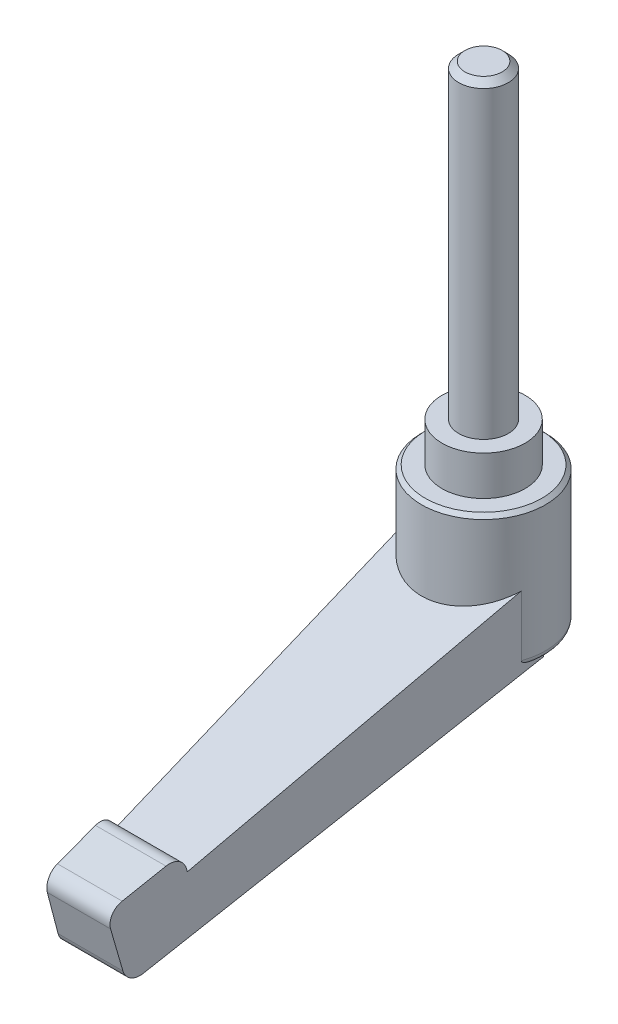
ISO-10303-21;
HEADER;
FILE_DESCRIPTION(('STEP AP214'),'2;1');
FILE_NAME('part.step','',(''),(''),'','','');
FILE_SCHEMA(('AUTOMOTIVE_DESIGN { 1 0 10303 214 1 1 1 1 }'));
ENDSEC;
DATA;
#1=APPLICATION_CONTEXT('core data for automotive mechanical design processes');
#2=APPLICATION_PROTOCOL_DEFINITION('international standard','automotive_design',2000,#1);
#3=PRODUCT_CONTEXT('',#1,'mechanical');
#4=PRODUCT('Part','Part','',(#3));
#5=PRODUCT_RELATED_PRODUCT_CATEGORY('part','',(#4));
#6=PRODUCT_DEFINITION_FORMATION('','',#4);
#7=PRODUCT_DEFINITION_CONTEXT('part definition',#1,'design');
#8=PRODUCT_DEFINITION('design','',#6,#7);
#9=PRODUCT_DEFINITION_SHAPE('','',#8);
#10=(LENGTH_UNIT() NAMED_UNIT(*) SI_UNIT(.MILLI.,.METRE.));
#11=(NAMED_UNIT(*) PLANE_ANGLE_UNIT() SI_UNIT($,.RADIAN.));
#12=(NAMED_UNIT(*) SI_UNIT($,.STERADIAN.) SOLID_ANGLE_UNIT());
#13=UNCERTAINTY_MEASURE_WITH_UNIT(LENGTH_MEASURE(1.E-05),#10,'distance_accuracy_value','');
#14=(GEOMETRIC_REPRESENTATION_CONTEXT(3) GLOBAL_UNCERTAINTY_ASSIGNED_CONTEXT((#13)) GLOBAL_UNIT_ASSIGNED_CONTEXT((#10,
#11,#12)) REPRESENTATION_CONTEXT('',''));
#15=CARTESIAN_POINT('',(0.,0.,0.));
#16=DIRECTION('',(0.,0.,1.));
#17=DIRECTION('',(1.,0.,0.));
#18=AXIS2_PLACEMENT_3D('',#15,#16,#17);
#19=CARTESIAN_POINT('',(22.5,-70.,30.));
#20=DIRECTION('',(0.,-1.,0.));
#21=DIRECTION('',(0.,0.,-1.));
#22=AXIS2_PLACEMENT_3D('',#19,#20,#21);
#23=PLANE('',#22);
#24=CARTESIAN_POINT('',(22.5,-70.,30.));
#25=DIRECTION('',(0.,-1.,0.));
#26=DIRECTION('',(0.,0.,-1.));
#27=AXIS2_PLACEMENT_3D('',#24,#25,#26);
#28=CIRCLE('',#27,6.06923098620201);
#29=CARTESIAN_POINT('',(22.5,-70.,23.930769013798));
#30=VERTEX_POINT('',#29);
#31=EDGE_CURVE('E19',#30,#30,#28,.F.);
#32=ORIENTED_EDGE('',*,*,#31,.F.);
#33=EDGE_LOOP('',(#32));
#34=FACE_BOUND('',#33,.T.);
#35=ADVANCED_FACE('F16',(#34),#23,.T.);
#36=CARTESIAN_POINT('',(22.5,-68.5,30.));
#37=DIRECTION('',(0.,-1.,0.));
#38=DIRECTION('',(0.,0.,-1.));
#39=AXIS2_PLACEMENT_3D('',#36,#37,#38);
#40=CYLINDRICAL_SURFACE('',#39,6.06923098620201);
#41=ORIENTED_EDGE('',*,*,#31,.T.);
#42=EDGE_LOOP('',(#41));
#43=FACE_BOUND('',#42,.T.);
#44=CARTESIAN_POINT('',(22.5,-66.9999999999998,30.));
#45=DIRECTION('',(0.,-0.965925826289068,-0.258819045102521));
#46=DIRECTION('',(0.,-0.258819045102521,0.965925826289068));
#47=AXIS2_PLACEMENT_3D('',#44,#45,#46);
#48=ELLIPSE('',#47,6.28333027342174,6.06923098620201);
#49=CARTESIAN_POINT('',(16.430769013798,-67.,30.0000000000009));
#50=VERTEX_POINT('',#49);
#51=CARTESIAN_POINT('',(28.569230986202,-67.,30.0000000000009));
#52=VERTEX_POINT('',#51);
#53=EDGE_CURVE('E94',#50,#52,#48,.F.);
#54=ORIENTED_EDGE('',*,*,#53,.F.);
#55=CARTESIAN_POINT('',(22.5,-67.,30.));
#56=DIRECTION('',(0.,-1.,0.));
#57=DIRECTION('',(0.,0.,-1.));
#58=AXIS2_PLACEMENT_3D('',#55,#56,#57);
#59=CIRCLE('',#58,6.06923098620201);
#60=EDGE_CURVE('E109',#52,#50,#59,.F.);
#61=ORIENTED_EDGE('',*,*,#60,.F.);
#62=EDGE_LOOP('',(#54,#61));
#63=FACE_BOUND('',#62,.T.);
#64=ADVANCED_FACE('F110',(#43,#63),#40,.T.);
#65=CARTESIAN_POINT('',(32.23,-72.0642139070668,83.6683718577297));
#66=DIRECTION('',(0.,0.264237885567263,-0.964457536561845));
#67=DIRECTION('',(0.,0.964457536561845,0.264237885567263));
#68=AXIS2_PLACEMENT_3D('',#65,#66,#67);
#69=PLANE('',#68);
#70=DIRECTION('',(0.0184741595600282,-0.964292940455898,-0.264192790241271));
#71=VECTOR('',#70,1.);
#72=CARTESIAN_POINT('',(28.3975822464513,-71.5214338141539,83.8170803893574));
#73=LINE('',#72,#71);
#74=CARTESIAN_POINT('',(28.3975822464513,-71.5214338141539,83.8170803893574));
#75=VERTEX_POINT('',#74);
#76=CARTESIAN_POINT('',(28.4079809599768,-72.0642139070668,83.6683718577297));
#77=VERTEX_POINT('',#76);
#78=EDGE_CURVE('E380',#75,#77,#73,.T.);
#79=ORIENTED_EDGE('',*,*,#78,.T.);
#80=DIRECTION('',(1.,0.,0.));
#81=VECTOR('',#80,1.);
#82=CARTESIAN_POINT('',(32.23,-72.0642139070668,83.6683718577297));
#83=LINE('',#82,#81);
#84=CARTESIAN_POINT('',(16.592019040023,-72.0642139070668,83.6683718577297));
#85=VERTEX_POINT('',#84);
#86=EDGE_CURVE('E187',#85,#77,#83,.T.);
#87=ORIENTED_EDGE('',*,*,#86,.F.);
#88=DIRECTION('',(0.0184741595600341,0.964292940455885,0.264192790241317));
#89=VECTOR('',#88,1.);
#90=CARTESIAN_POINT('',(16.592019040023,-72.0642139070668,83.6683718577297));
#91=LINE('',#90,#89);
#92=CARTESIAN_POINT('',(16.6024177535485,-71.5214338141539,83.8170803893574));
#93=VERTEX_POINT('',#92);
#94=EDGE_CURVE('E112',#85,#93,#91,.T.);
#95=ORIENTED_EDGE('',*,*,#94,.T.);
#96=DIRECTION('',(-1.,0.,0.));
#97=VECTOR('',#96,1.);
#98=CARTESIAN_POINT('',(32.23,-71.5214338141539,83.8170803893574));
#99=LINE('',#98,#97);
#100=EDGE_CURVE('E378',#75,#93,#99,.T.);
#101=ORIENTED_EDGE('',*,*,#100,.F.);
#102=EDGE_LOOP('',(#79,#87,#95,#101));
#103=FACE_BOUND('',#102,.T.);
#104=ADVANCED_FACE('F257',(#103),#69,.T.);
#105=CARTESIAN_POINT('',(32.23,-72.1820285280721,86.228224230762));
#106=DIRECTION('',(-1.,0.,0.));
#107=DIRECTION('',(0.,0.,1.));
#108=AXIS2_PLACEMENT_3D('',#105,#106,#107);
#109=CYLINDRICAL_SURFACE('',#108,2.5);
#110=CARTESIAN_POINT('',(28.2289786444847,-72.1820285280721,86.228224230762));
#111=DIRECTION('',(0.997564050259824,0.,0.069756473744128));
#112=DIRECTION('',(-0.069756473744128,0.,0.997564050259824));
#113=AXIS2_PLACEMENT_3D('',#110,#111,#112);
#114=ELLIPSE('',#113,2.50610474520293,2.5);
#115=CARTESIAN_POINT('',(28.1824688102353,-69.772129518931,86.8933458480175));
#116=VERTEX_POINT('',#115);
#117=EDGE_CURVE('E183',#75,#116,#114,.T.);
#118=ORIENTED_EDGE('',*,*,#117,.F.);
#119=ORIENTED_EDGE('',*,*,#100,.T.);
#120=CARTESIAN_POINT('',(16.7710213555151,-72.1820285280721,86.228224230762));
#121=DIRECTION('',(0.997564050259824,0.,-0.069756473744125));
#122=DIRECTION('',(-0.069756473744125,0.,-0.997564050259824));
#123=AXIS2_PLACEMENT_3D('',#120,#121,#122);
#124=ELLIPSE('',#123,2.50610474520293,2.5);
#125=CARTESIAN_POINT('',(16.8175311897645,-69.772129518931,86.8933458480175));
#126=VERTEX_POINT('',#125);
#127=EDGE_CURVE('E202',#93,#126,#124,.T.);
#128=ORIENTED_EDGE('',*,*,#127,.T.);
#129=DIRECTION('',(1.,0.,0.));
#130=VECTOR('',#129,1.);
#131=CARTESIAN_POINT('',(32.23,-69.772129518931,86.8933458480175));
#132=LINE('',#131,#130);
#133=EDGE_CURVE('E376',#116,#126,#132,.F.);
#134=ORIENTED_EDGE('',*,*,#133,.F.);
#135=EDGE_LOOP('',(#118,#119,#128,#134));
#136=FACE_BOUND('',#135,.T.);
#137=ADVANCED_FACE('F253',(#136),#109,.T.);
#138=CARTESIAN_POINT('',(32.23,-69.772129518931,86.8933458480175));
#139=DIRECTION('',(0.,0.96395960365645,0.266048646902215));
#140=DIRECTION('',(0.,-0.266048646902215,0.96395960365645));
#141=AXIS2_PLACEMENT_3D('',#138,#139,#140);
#142=PLANE('',#141);
#143=DIRECTION('',(-0.0672540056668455,-0.265446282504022,0.961777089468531));
#144=VECTOR('',#143,1.);
#145=CARTESIAN_POINT('',(28.1824688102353,-69.772129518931,86.8933458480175));
#146=LINE('',#145,#144);
#147=CARTESIAN_POINT('',(27.7207106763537,-71.5946526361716,93.49679481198));
#148=VERTEX_POINT('',#147);
#149=EDGE_CURVE('E180',#116,#148,#146,.T.);
#150=ORIENTED_EDGE('',*,*,#149,.F.);
#151=ORIENTED_EDGE('',*,*,#133,.T.);
#152=DIRECTION('',(0.0672540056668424,-0.265446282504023,0.961777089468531));
#153=VECTOR('',#152,1.);
#154=CARTESIAN_POINT('',(16.8175311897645,-69.772129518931,86.8933458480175));
#155=LINE('',#154,#153);
#156=CARTESIAN_POINT('',(17.2792893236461,-71.5946526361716,93.49679481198));
#157=VERTEX_POINT('',#156);
#158=EDGE_CURVE('E200',#126,#157,#155,.T.);
#159=ORIENTED_EDGE('',*,*,#158,.T.);
#160=DIRECTION('',(-1.,0.,0.));
#161=VECTOR('',#160,1.);
#162=CARTESIAN_POINT('',(32.23,-71.5946526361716,93.4967948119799));
#163=LINE('',#162,#161);
#164=EDGE_CURVE('E373',#148,#157,#163,.T.);
#165=ORIENTED_EDGE('',*,*,#164,.F.);
#166=EDGE_LOOP('',(#150,#151,#159,#165));
#167=FACE_BOUND('',#166,.T.);
#168=ADVANCED_FACE('F249',(#167),#142,.T.);
#169=CARTESIAN_POINT('',(32.23,-74.0045516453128,92.8316731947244));
#170=DIRECTION('',(-1.,0.,0.));
#171=DIRECTION('',(0.,0.,1.));
#172=AXIS2_PLACEMENT_3D('',#169,#170,#171);
#173=CYLINDRICAL_SURFACE('',#172,2.50000000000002);
#174=CARTESIAN_POINT('',(27.7672205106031,-74.0045516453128,92.8316731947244));
#175=DIRECTION('',(0.997564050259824,0.,0.069756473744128));
#176=DIRECTION('',(-0.069756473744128,0.,0.997564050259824));
#177=AXIS2_PLACEMENT_3D('',#174,#175,#176);
#178=ELLIPSE('',#177,2.50610474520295,2.50000000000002);
#179=CARTESIAN_POINT('',(27.598703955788,-74.6696732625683,95.2415722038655));
#180=VERTEX_POINT('',#179);
#181=EDGE_CURVE('E179',#148,#180,#178,.T.);
#182=ORIENTED_EDGE('',*,*,#181,.F.);
#183=ORIENTED_EDGE('',*,*,#164,.T.);
#184=CARTESIAN_POINT('',(17.2327794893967,-74.0045516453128,92.8316731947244));
#185=DIRECTION('',(0.997564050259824,0.,-0.069756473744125));
#186=DIRECTION('',(-0.069756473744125,0.,-0.997564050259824));
#187=AXIS2_PLACEMENT_3D('',#184,#185,#186);
#188=ELLIPSE('',#187,2.50610474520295,2.50000000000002);
#189=CARTESIAN_POINT('',(17.4012960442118,-74.6696732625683,95.2415722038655));
#190=VERTEX_POINT('',#189);
#191=EDGE_CURVE('E199',#157,#190,#188,.T.);
#192=ORIENTED_EDGE('',*,*,#191,.T.);
#193=DIRECTION('',(1.,0.,0.));
#194=VECTOR('',#193,1.);
#195=CARTESIAN_POINT('',(32.23,-74.6696732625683,95.2415722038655));
#196=LINE('',#195,#194);
#197=EDGE_CURVE('E370',#180,#190,#196,.F.);
#198=ORIENTED_EDGE('',*,*,#197,.F.);
#199=EDGE_LOOP('',(#182,#183,#192,#198));
#200=FACE_BOUND('',#199,.T.);
#201=ADVANCED_FACE('F245',(#200),#173,.T.);
#202=CARTESIAN_POINT('',(32.23,-74.6696732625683,95.2415722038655));
#203=DIRECTION('',(0.,-0.266048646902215,0.96395960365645));
#204=DIRECTION('',(0.,-0.96395960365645,-0.266048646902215));
#205=AXIS2_PLACEMENT_3D('',#202,#203,#204);
#206=PLANE('',#205);
#207=DIRECTION('',(0.0186007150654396,-0.963792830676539,-0.266002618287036));
#208=VECTOR('',#207,1.);
#209=CARTESIAN_POINT('',(27.598703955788,-74.6696732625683,95.2415722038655));
#210=LINE('',#209,#208);
#211=CARTESIAN_POINT('',(27.7288636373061,-81.4138746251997,93.3802020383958));
#212=VERTEX_POINT('',#211);
#213=EDGE_CURVE('E176',#180,#212,#210,.T.);
#214=ORIENTED_EDGE('',*,*,#213,.F.);
#215=ORIENTED_EDGE('',*,*,#197,.T.);
#216=DIRECTION('',(-0.0186007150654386,-0.963792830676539,-0.266002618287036));
#217=VECTOR('',#216,1.);
#218=CARTESIAN_POINT('',(17.4012960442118,-74.6696732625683,95.2415722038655));
#219=LINE('',#218,#217);
#220=CARTESIAN_POINT('',(17.2711363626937,-81.4138746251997,93.3802020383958));
#221=VERTEX_POINT('',#220);
#222=EDGE_CURVE('E197',#190,#221,#219,.T.);
#223=ORIENTED_EDGE('',*,*,#222,.T.);
#224=DIRECTION('',(-1.,0.,0.));
#225=VECTOR('',#224,1.);
#226=CARTESIAN_POINT('',(32.23,-81.4138746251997,93.3802020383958));
#227=LINE('',#226,#225);
#228=EDGE_CURVE('E108',#212,#221,#227,.T.);
#229=ORIENTED_EDGE('',*,*,#228,.F.);
#230=EDGE_LOOP('',(#214,#215,#223,#229));
#231=FACE_BOUND('',#230,.T.);
#232=ADVANCED_FACE('F241',(#231),#206,.T.);
#233=CARTESIAN_POINT('',(32.23,-80.7487530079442,90.9703030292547));
#234=DIRECTION('',(-1.,0.,0.));
#235=DIRECTION('',(0.,0.,1.));
#236=AXIS2_PLACEMENT_3D('',#233,#234,#235);
#237=CYLINDRICAL_SURFACE('',#236,2.50000000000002);
#238=CARTESIAN_POINT('',(27.8973801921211,-80.7487530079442,90.9703030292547));
#239=DIRECTION('',(0.997564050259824,0.,0.069756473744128));
#240=DIRECTION('',(-0.069756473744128,0.,0.997564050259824));
#241=AXIS2_PLACEMENT_3D('',#238,#239,#240);
#242=ELLIPSE('',#241,2.50610474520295,2.50000000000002);
#243=CARTESIAN_POINT('',(27.9426261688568,-83.1635675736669,90.3232554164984));
#244=VERTEX_POINT('',#243);
#245=EDGE_CURVE('E175',#212,#244,#242,.T.);
#246=ORIENTED_EDGE('',*,*,#245,.F.);
#247=ORIENTED_EDGE('',*,*,#228,.T.);
#248=CARTESIAN_POINT('',(17.1026198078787,-80.7487530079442,90.9703030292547));
#249=DIRECTION('',(0.997564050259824,0.,-0.069756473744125));
#250=DIRECTION('',(-0.069756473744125,0.,-0.997564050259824));
#251=AXIS2_PLACEMENT_3D('',#248,#249,#250);
#252=ELLIPSE('',#251,2.50610474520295,2.50000000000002);
#253=CARTESIAN_POINT('',(17.0573738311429,-83.1635675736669,90.3232554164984));
#254=VERTEX_POINT('',#253);
#255=EDGE_CURVE('E196',#221,#254,#252,.T.);
#256=ORIENTED_EDGE('',*,*,#255,.T.);
#257=DIRECTION('',(1.,0.,0.));
#258=VECTOR('',#257,1.);
#259=CARTESIAN_POINT('',(32.23,-83.1635675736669,90.3232554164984));
#260=LINE('',#259,#258);
#261=EDGE_CURVE('E107',#244,#254,#260,.F.);
#262=ORIENTED_EDGE('',*,*,#261,.F.);
#263=EDGE_LOOP('',(#246,#247,#256,#262));
#264=FACE_BOUND('',#263,.T.);
#265=ADVANCED_FACE('F238',(#264),#237,.T.);
#266=CARTESIAN_POINT('',(32.23,-83.1635675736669,90.3232554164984));
#267=DIRECTION('',(0.,-0.965925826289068,-0.258819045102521));
#268=DIRECTION('',(0.,0.258819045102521,-0.965925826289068));
#269=AXIS2_PLACEMENT_3D('',#266,#267,#268);
#270=PLANE('',#269);
#271=DIRECTION('',(-1.,0.,0.));
#272=VECTOR('',#271,1.);
#273=CARTESIAN_POINT('',(32.23,-67.,30.));
#274=LINE('',#273,#272);
#275=CARTESIAN_POINT('',(13.5,-67.,30.0000000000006));
#276=VERTEX_POINT('',#275);
#277=CARTESIAN_POINT('',(12.8391608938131,-66.9999999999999,30.));
#278=VERTEX_POINT('',#277);
#279=EDGE_CURVE('E358',#276,#278,#274,.T.);
#280=ORIENTED_EDGE('',*,*,#279,.F.);
#281=DIRECTION('',(1.,0.,0.));
#282=VECTOR('',#281,1.);
#283=CARTESIAN_POINT('',(22.5,-67.,30.0000000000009));
#284=LINE('',#283,#282);
#285=EDGE_CURVE('E105',#50,#276,#284,.F.);
#286=ORIENTED_EDGE('',*,*,#285,.F.);
#287=ORIENTED_EDGE('',*,*,#53,.T.);
#288=DIRECTION('',(1.,0.,0.));
#289=VECTOR('',#288,1.);
#290=CARTESIAN_POINT('',(22.5,-67.,30.0000000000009));
#291=LINE('',#290,#289);
#292=CARTESIAN_POINT('',(31.5,-67.,30.0000000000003));
#293=VERTEX_POINT('',#292);
#294=EDGE_CURVE('E102',#293,#52,#291,.F.);
#295=ORIENTED_EDGE('',*,*,#294,.F.);
#296=DIRECTION('',(-1.,0.,0.));
#297=VECTOR('',#296,1.);
#298=CARTESIAN_POINT('',(32.23,-66.9999999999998,30.));
#299=LINE('',#298,#297);
#300=CARTESIAN_POINT('',(32.1608391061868,-66.9999999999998,30.));
#301=VERTEX_POINT('',#300);
#302=EDGE_CURVE('E121',#301,#293,#299,.T.);
#303=ORIENTED_EDGE('',*,*,#302,.F.);
#304=DIRECTION('',(0.0673905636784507,0.258230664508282,-0.963729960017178));
#305=VECTOR('',#304,1.);
#306=CARTESIAN_POINT('',(27.9426261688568,-83.1635675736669,90.3232554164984));
#307=LINE('',#306,#305);
#308=EDGE_CURVE('E172',#244,#301,#307,.T.);
#309=ORIENTED_EDGE('',*,*,#308,.F.);
#310=ORIENTED_EDGE('',*,*,#261,.T.);
#311=DIRECTION('',(-0.0673905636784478,0.258230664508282,-0.963729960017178));
#312=VECTOR('',#311,1.);
#313=CARTESIAN_POINT('',(17.0573738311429,-83.1635675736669,90.3232554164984));
#314=LINE('',#313,#312);
#315=EDGE_CURVE('E193',#254,#278,#314,.T.);
#316=ORIENTED_EDGE('',*,*,#315,.T.);
#317=EDGE_LOOP('',(#280,#286,#287,#295,#303,#309,#310,#316));
#318=FACE_BOUND('',#317,.T.);
#319=ADVANCED_FACE('F99',(#318),#270,.T.);
#320=CARTESIAN_POINT('',(32.23,-66.9999999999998,30.));
#321=DIRECTION('',(0.,0.,-1.));
#322=DIRECTION('',(-1.,0.,0.));
#323=AXIS2_PLACEMENT_3D('',#320,#321,#322);
#324=PLANE('',#323);
#325=ORIENTED_EDGE('',*,*,#279,.T.);
#326=DIRECTION('',(0.,1.,0.));
#327=VECTOR('',#326,1.);
#328=CARTESIAN_POINT('',(12.8391608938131,-60.0000000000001,30.));
#329=LINE('',#328,#327);
#330=CARTESIAN_POINT('',(12.8391608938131,-66.7505275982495,30.0000000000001));
#331=VERTEX_POINT('',#330);
#332=EDGE_CURVE('E191',#278,#331,#329,.T.);
#333=ORIENTED_EDGE('',*,*,#332,.T.);
#334=CARTESIAN_POINT('',(13.5,-67.,30.));
#335=CARTESIAN_POINT('',(13.4718991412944,-66.9999995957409,30.));
#336=CARTESIAN_POINT('',(13.4438120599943,-66.9988146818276,30.));
#337=CARTESIAN_POINT('',(13.3878374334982,-66.9940872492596,30.));
#338=CARTESIAN_POINT('',(13.3599498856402,-66.9905447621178,30.));
#339=CARTESIAN_POINT('',(13.2768035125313,-66.9763912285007,30.));
#340=CARTESIAN_POINT('',(13.2221018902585,-66.9622541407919,30.));
#341=CARTESIAN_POINT('',(13.1158532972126,-66.9249916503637,30.));
#342=CARTESIAN_POINT('',(13.064308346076,-66.9018605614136,30.));
#343=CARTESIAN_POINT('',(12.9659501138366,-66.8473110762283,30.));
#344=CARTESIAN_POINT('',(12.9191237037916,-66.8159166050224,30.));
#345=CARTESIAN_POINT('',(12.8630162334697,-66.7710398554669,30.));
#346=CARTESIAN_POINT('',(12.8509621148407,-66.7609217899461,30.));
#347=CARTESIAN_POINT('',(12.8391608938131,-66.7505275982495,30.));
#348=B_SPLINE_CURVE_WITH_KNOTS('',3,(#334,#335,#336,#337,#338,#339,#340,#341,#342,#343,#344,
#345,#346,#347),.UNSPECIFIED.,.F.,.F.,(4,2,2,2,2,2,4),(0.,0.0842502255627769,0.168499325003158,
0.337118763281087,0.505844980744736,0.674087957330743,0.721281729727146),.UNSPECIFIED.);
#349=EDGE_CURVE('E171',#276,#331,#348,.T.);
#350=ORIENTED_EDGE('',*,*,#349,.F.);
#351=EDGE_LOOP('',(#325,#333,#350));
#352=FACE_BOUND('',#351,.T.);
#353=ADVANCED_FACE('F228',(#352),#324,.T.);
#354=CARTESIAN_POINT('',(32.23,-66.9999999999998,30.));
#355=DIRECTION('',(0.,0.,-1.));
#356=DIRECTION('',(-1.,0.,0.));
#357=AXIS2_PLACEMENT_3D('',#354,#355,#356);
#358=PLANE('',#357);
#359=DIRECTION('',(0.,1.,0.));
#360=VECTOR('',#359,1.);
#361=CARTESIAN_POINT('',(32.1608391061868,-60.0000000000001,30.));
#362=LINE('',#361,#360);
#363=CARTESIAN_POINT('',(32.1608391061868,-66.7505275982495,30.));
#364=VERTEX_POINT('',#363);
#365=EDGE_CURVE('E169',#301,#364,#362,.T.);
#366=ORIENTED_EDGE('',*,*,#365,.F.);
#367=ORIENTED_EDGE('',*,*,#302,.T.);
#368=CARTESIAN_POINT('',(32.1608391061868,-66.7505275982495,30.));
#369=CARTESIAN_POINT('',(32.1397483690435,-66.769097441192,30.));
#370=CARTESIAN_POINT('',(32.1178852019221,-66.7867691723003,30.));
#371=CARTESIAN_POINT('',(32.0727506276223,-66.820211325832,30.));
#372=CARTESIAN_POINT('',(32.049479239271,-66.8359817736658,30.));
#373=CARTESIAN_POINT('',(31.9777223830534,-66.8803055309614,30.));
#374=CARTESIAN_POINT('',(31.9273249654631,-66.9058442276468,30.));
#375=CARTESIAN_POINT('',(31.8229579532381,-66.948090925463,30.));
#376=CARTESIAN_POINT('',(31.7689861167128,-66.964793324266,30.));
#377=CARTESIAN_POINT('',(31.6591171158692,-66.9888513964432,30.));
#378=CARTESIAN_POINT('',(31.6032259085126,-66.9962337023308,30.));
#379=CARTESIAN_POINT('',(31.5314593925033,-66.9996304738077,30.));
#380=CARTESIAN_POINT('',(31.5157260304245,-67.000002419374,30.));
#381=CARTESIAN_POINT('',(31.5,-67.,30.));
#382=B_SPLINE_CURVE_WITH_KNOTS('',3,(#368,#369,#370,#371,#372,#373,#374,#375,#376,#377,#378,
#379,#380,#381),.UNSPECIFIED.,.F.,.F.,(4,2,2,2,2,2,4),(0.,0.0842502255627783,0.168499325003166,
0.337118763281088,0.505844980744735,0.674087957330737,0.721281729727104),.UNSPECIFIED.);
#383=EDGE_CURVE('E323',#364,#293,#382,.T.);
#384=ORIENTED_EDGE('',*,*,#383,.F.);
#385=EDGE_LOOP('',(#366,#367,#384));
#386=FACE_BOUND('',#385,.T.);
#387=ADVANCED_FACE('F233',(#386),#358,.T.);
#388=CARTESIAN_POINT('',(22.5,-67.,22.465384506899));
#389=DIRECTION('',(0.,-1.,0.));
#390=DIRECTION('',(0.,0.,-1.));
#391=AXIS2_PLACEMENT_3D('',#388,#389,#390);
#392=PLANE('',#391);
#393=ORIENTED_EDGE('',*,*,#294,.T.);
#394=ORIENTED_EDGE('',*,*,#60,.T.);
#395=ORIENTED_EDGE('',*,*,#285,.T.);
#396=CARTESIAN_POINT('',(22.5,-67.,30.));
#397=DIRECTION('',(0.,1.,0.));
#398=DIRECTION('',(1.,0.,0.));
#399=AXIS2_PLACEMENT_3D('',#396,#397,#398);
#400=CIRCLE('',#399,9.);
#401=EDGE_CURVE('E117',#293,#276,#400,.T.);
#402=ORIENTED_EDGE('',*,*,#401,.F.);
#403=EDGE_LOOP('',(#393,#394,#395,#402));
#404=FACE_BOUND('',#403,.T.);
#405=ADVANCED_FACE('F115',(#404),#392,.T.);
#406=CARTESIAN_POINT('',(15.6117703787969,-60.0000000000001,69.6501629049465));
#407=DIRECTION('',(0.997564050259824,0.,-0.069756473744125));
#408=DIRECTION('',(-0.069756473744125,0.,-0.997564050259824));
#409=AXIS2_PLACEMENT_3D('',#406,#407,#408);
#410=PLANE('',#409);
#411=ORIENTED_EDGE('',*,*,#332,.F.);
#412=ORIENTED_EDGE('',*,*,#315,.F.);
#413=ORIENTED_EDGE('',*,*,#255,.F.);
#414=ORIENTED_EDGE('',*,*,#222,.F.);
#415=ORIENTED_EDGE('',*,*,#191,.F.);
#416=ORIENTED_EDGE('',*,*,#158,.F.);
#417=ORIENTED_EDGE('',*,*,#127,.F.);
#418=ORIENTED_EDGE('',*,*,#94,.F.);
#419=DIRECTION('',(0.0665654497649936,-0.298994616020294,0.951930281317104));
#420=VECTOR('',#419,1.);
#421=CARTESIAN_POINT('',(13.0723342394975,-56.254708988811,33.3345341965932));
#422=LINE('',#421,#420);
#423=CARTESIAN_POINT('',(13.0723342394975,-56.254708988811,33.3345341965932));
#424=VERTEX_POINT('',#423);
#425=EDGE_CURVE('E188',#424,#85,#422,.T.);
#426=ORIENTED_EDGE('',*,*,#425,.F.);
#427=DIRECTION('',(0.,-1.,0.));
#428=VECTOR('',#427,1.);
#429=CARTESIAN_POINT('',(13.0723342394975,-55.8,33.3345341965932));
#430=LINE('',#429,#428);
#431=CARTESIAN_POINT('',(13.0723342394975,-66.,33.3345341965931));
#432=VERTEX_POINT('',#431);
#433=EDGE_CURVE('E162',#432,#424,#430,.F.);
#434=ORIENTED_EDGE('',*,*,#433,.F.);
#435=CARTESIAN_POINT('',(12.8391608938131,-66.7505275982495,30.0000000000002));
#436=CARTESIAN_POINT('',(12.8430417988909,-66.7539418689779,30.0554995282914));
#437=CARTESIAN_POINT('',(12.8469245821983,-66.7568893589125,30.1110259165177));
#438=CARTESIAN_POINT('',(12.8546928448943,-66.7619022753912,30.2221172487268));
#439=CARTESIAN_POINT('',(12.8585783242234,-66.7639677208,30.2776821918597));
#440=CARTESIAN_POINT('',(12.8702528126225,-66.7689249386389,30.4446351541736));
#441=CARTESIAN_POINT('',(12.8780445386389,-66.7705645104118,30.5560620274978));
#442=CARTESIAN_POINT('',(12.8936347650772,-66.7706555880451,30.7790126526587));
#443=CARTESIAN_POINT('',(12.9014332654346,-66.7691042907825,30.8905364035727));
#444=CARTESIAN_POINT('',(12.9170366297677,-66.7626680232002,31.1136749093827));
#445=CARTESIAN_POINT('',(12.924841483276,-66.7577776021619,31.2252895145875));
#446=CARTESIAN_POINT('',(12.9404308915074,-66.7442282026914,31.4482284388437));
#447=CARTESIAN_POINT('',(12.9482154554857,-66.735571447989,31.5595528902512));
#448=CARTESIAN_POINT('',(12.9637503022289,-66.7137006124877,31.7817115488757));
#449=CARTESIAN_POINT('',(12.971500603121,-66.7004893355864,31.8925460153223));
#450=CARTESIAN_POINT('',(12.981954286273,-66.6785900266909,32.0420406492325));
#451=CARTESIAN_POINT('',(12.9846843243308,-66.6724915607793,32.0810820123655));
#452=CARTESIAN_POINT('',(12.990134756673,-66.6594587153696,32.1590268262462));
#453=CARTESIAN_POINT('',(12.9928551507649,-66.6525243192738,32.1979302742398));
#454=CARTESIAN_POINT('',(13.0010046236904,-66.6303021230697,32.3144731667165));
#455=CARTESIAN_POINT('',(13.0064154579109,-66.6136085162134,32.3918517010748));
#456=CARTESIAN_POINT('',(13.01738651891,-66.57454970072,32.5487451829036));
#457=CARTESIAN_POINT('',(13.0229432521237,-66.5519726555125,32.6282101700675));
#458=CARTESIAN_POINT('',(13.0311433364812,-66.5125817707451,32.745476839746));
#459=CARTESIAN_POINT('',(13.0338515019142,-66.4985477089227,32.784205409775));
#460=CARTESIAN_POINT('',(13.0392049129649,-66.4682160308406,32.8607627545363));
#461=CARTESIAN_POINT('',(13.0418501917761,-66.4519196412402,32.8985920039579));
#462=CARTESIAN_POINT('',(13.0465617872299,-66.4198047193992,32.9659709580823));
#463=CARTESIAN_POINT('',(13.0486439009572,-66.4044662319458,32.9957465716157));
#464=CARTESIAN_POINT('',(13.0527221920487,-66.3714540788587,33.0540688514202));
#465=CARTESIAN_POINT('',(13.0547182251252,-66.3537766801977,33.0826134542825));
#466=CARTESIAN_POINT('',(13.0585901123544,-66.3153634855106,33.1379840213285));
#467=CARTESIAN_POINT('',(13.0604647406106,-66.2946019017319,33.1647924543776));
#468=CARTESIAN_POINT('',(13.0639850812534,-66.2493615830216,33.2151356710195));
#469=CARTESIAN_POINT('',(13.0656313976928,-66.2248930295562,33.2386790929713));
#470=CARTESIAN_POINT('',(13.067871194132,-66.1836168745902,33.2707096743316));
#471=CARTESIAN_POINT('',(13.0686034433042,-66.1683708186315,33.2811813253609));
#472=CARTESIAN_POINT('',(13.0699055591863,-66.13656994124,33.299802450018));
#473=CARTESIAN_POINT('',(13.0704760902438,-66.1200208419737,33.3079614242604));
#474=CARTESIAN_POINT('',(13.0713849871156,-66.0866155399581,33.3209592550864));
#475=CARTESIAN_POINT('',(13.0717339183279,-66.0698204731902,33.3259492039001));
#476=CARTESIAN_POINT('',(13.0720903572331,-66.0440474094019,33.3310465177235));
#477=CARTESIAN_POINT('',(13.0721813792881,-66.0352977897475,33.3323481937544));
#478=CARTESIAN_POINT('',(13.0723034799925,-66.01770091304,33.3340943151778));
#479=CARTESIAN_POINT('',(13.0723344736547,-66.0088535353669,33.3345375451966));
#480=CARTESIAN_POINT('',(13.0723342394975,-66.,33.3345341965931));
#481=B_SPLINE_CURVE_WITH_KNOTS('',3,(#435,#436,#437,#438,#439,#440,#441,#442,#443,#444,#445,
#446,#447,#448,#449,#450,#451,#452,#453,#454,#455,#456,#457,#458,#459,#460,#461,#462,#463,#464,
#465,#466,#467,#468,#469,#470,#471,#472,#473,#474,#475,#476,#477,#478,#479,#480),.UNSPECIFIED.,
.F.,.F.,(4,2,2,2,2,2,2,2,2,2,2,2,2,2,2,2,2,2,2,2,2,2,4),(0.,0.167214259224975,0.334424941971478,
0.669506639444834,1.00488282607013,1.34080778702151,1.67653467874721,2.01205525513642,
2.13087487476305,2.24969685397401,2.48762436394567,2.73571678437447,2.85951074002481,
2.98323783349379,3.08383819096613,3.18460109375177,3.28625962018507,3.38764383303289,
3.44302569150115,3.49817662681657,3.55044837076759,3.57694913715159,3.60348739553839),.UNSPECIFIED.);
#482=EDGE_CURVE('E332',#331,#432,#481,.T.);
#483=ORIENTED_EDGE('',*,*,#482,.F.);
#484=EDGE_LOOP('',(#411,#412,#413,#414,#415,#416,#417,#418,#426,#434,#483));
#485=FACE_BOUND('',#484,.T.);
#486=ADVANCED_FACE('F338',(#485),#410,.F.);
#487=CARTESIAN_POINT('',(32.23,-55.2073552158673,30.0000000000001));
#488=DIRECTION('',(0.,0.954046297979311,0.299659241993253));
#489=DIRECTION('',(0.,-0.299659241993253,0.954046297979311));
#490=AXIS2_PLACEMENT_3D('',#487,#488,#489);
#491=PLANE('',#490);
#492=ORIENTED_EDGE('',*,*,#86,.T.);
#493=DIRECTION('',(-0.0665654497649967,-0.298994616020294,0.951930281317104));
#494=VECTOR('',#493,1.);
#495=CARTESIAN_POINT('',(31.9276657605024,-56.254708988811,33.3345341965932));
#496=LINE('',#495,#494);
#497=CARTESIAN_POINT('',(31.9276657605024,-56.254708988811,33.3345341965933));
#498=VERTEX_POINT('',#497);
#499=EDGE_CURVE('E184',#498,#77,#496,.T.);
#500=ORIENTED_EDGE('',*,*,#499,.F.);
#501=CARTESIAN_POINT('',(22.5,-55.2073552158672,30.));
#502=DIRECTION('',(0.,0.954046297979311,0.299659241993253));
#503=DIRECTION('',(0.,-0.299659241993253,0.954046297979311));
#504=AXIS2_PLACEMENT_3D('',#501,#502,#503);
#505=ELLIPSE('',#504,10.4816716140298,10.);
#506=EDGE_CURVE('E316',#424,#498,#505,.T.);
#507=ORIENTED_EDGE('',*,*,#506,.F.);
#508=ORIENTED_EDGE('',*,*,#425,.T.);
#509=EDGE_LOOP('',(#492,#500,#507,#508));
#510=FACE_BOUND('',#509,.T.);
#511=ADVANCED_FACE('F341',(#510),#491,.T.);
#512=CARTESIAN_POINT('',(29.388229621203,-60.0000000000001,69.6501629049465));
#513=DIRECTION('',(0.997564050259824,0.,0.069756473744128));
#514=DIRECTION('',(0.069756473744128,0.,-0.997564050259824));
#515=AXIS2_PLACEMENT_3D('',#512,#513,#514);
#516=PLANE('',#515);
#517=ORIENTED_EDGE('',*,*,#308,.T.);
#518=ORIENTED_EDGE('',*,*,#365,.T.);
#519=CARTESIAN_POINT('',(31.9276657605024,-66.,33.3345341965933));
#520=CARTESIAN_POINT('',(31.9276655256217,-66.0088862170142,33.334537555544));
#521=CARTESIAN_POINT('',(31.927696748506,-66.0177660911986,33.3340910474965));
#522=CARTESIAN_POINT('',(31.9278197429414,-66.0354271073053,33.3323321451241));
#523=CARTESIAN_POINT('',(31.9279114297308,-66.0442083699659,33.3310209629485));
#524=CARTESIAN_POINT('',(31.9282706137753,-66.0700847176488,33.3258843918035));
#525=CARTESIAN_POINT('',(31.9286223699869,-66.0869488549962,33.3208540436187));
#526=CARTESIAN_POINT('',(31.9295114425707,-66.1194981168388,33.3081397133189));
#527=CARTESIAN_POINT('',(31.9300477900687,-66.1351888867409,33.3004695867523));
#528=CARTESIAN_POINT('',(31.9312665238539,-66.1654050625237,33.2830408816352));
#529=CARTESIAN_POINT('',(31.9319494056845,-66.1799262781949,33.2732752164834));
#530=CARTESIAN_POINT('',(31.9340590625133,-66.2197587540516,33.243105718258));
#531=CARTESIAN_POINT('',(31.9356201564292,-66.2435973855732,33.2207810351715));
#532=CARTESIAN_POINT('',(31.9389645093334,-66.2877869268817,33.1729545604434));
#533=CARTESIAN_POINT('',(31.9407484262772,-66.3081270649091,33.1474433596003));
#534=CARTESIAN_POINT('',(31.9449698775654,-66.3512865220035,33.0870737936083));
#535=CARTESIAN_POINT('',(31.9474510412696,-66.3732176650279,33.0515914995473));
#536=CARTESIAN_POINT('',(31.9525479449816,-66.4136408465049,32.9787023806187));
#537=CARTESIAN_POINT('',(31.955163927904,-66.4321263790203,32.9412920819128));
#538=CARTESIAN_POINT('',(31.9604927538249,-66.4664659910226,32.8650863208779));
#539=CARTESIAN_POINT('',(31.9632060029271,-66.4823069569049,32.8262850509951));
#540=CARTESIAN_POINT('',(31.9686868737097,-66.5117744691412,32.7479049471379));
#541=CARTESIAN_POINT('',(31.9714544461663,-66.5254029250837,32.708326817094));
#542=CARTESIAN_POINT('',(31.9773050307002,-66.5521103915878,32.6246595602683));
#543=CARTESIAN_POINT('',(31.9803921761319,-66.5650018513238,32.580511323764));
#544=CARTESIAN_POINT('',(31.9866006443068,-66.5889784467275,32.4917260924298));
#545=CARTESIAN_POINT('',(31.9897219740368,-66.6000632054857,32.4470889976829));
#546=CARTESIAN_POINT('',(31.9991334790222,-66.6310795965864,32.3124982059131));
#547=CARTESIAN_POINT('',(32.0054603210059,-66.6487263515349,32.2220201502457));
#548=CARTESIAN_POINT('',(32.0181713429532,-66.6794960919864,32.0402440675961));
#549=CARTESIAN_POINT('',(32.0245555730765,-66.6926146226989,31.9489453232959));
#550=CARTESIAN_POINT('',(32.0373675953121,-66.7152878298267,31.7657248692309));
#551=CARTESIAN_POINT('',(32.0437954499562,-66.7248351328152,31.673802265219));
#552=CARTESIAN_POINT('',(32.0566607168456,-66.7409580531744,31.4898203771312));
#553=CARTESIAN_POINT('',(32.0630981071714,-66.7475373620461,31.3977614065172));
#554=CARTESIAN_POINT('',(32.0759812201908,-66.7581520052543,31.2135243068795));
#555=CARTESIAN_POINT('',(32.0824269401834,-66.7621880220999,31.1213462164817));
#556=CARTESIAN_POINT('',(32.0928907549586,-66.7668701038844,30.9717066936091));
#557=CARTESIAN_POINT('',(32.0969074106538,-66.768220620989,30.9142658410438));
#558=CARTESIAN_POINT('',(32.1049423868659,-66.7700578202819,30.799360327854));
#559=CARTESIAN_POINT('',(32.1089607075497,-66.7705443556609,30.7418956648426));
#560=CARTESIAN_POINT('',(32.1169977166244,-66.7706649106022,30.6269610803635));
#561=CARTESIAN_POINT('',(32.1210164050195,-66.7702988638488,30.5694911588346));
#562=CARTESIAN_POINT('',(32.1290160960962,-66.7687125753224,30.4550902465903));
#563=CARTESIAN_POINT('',(32.1329971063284,-66.767500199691,30.3981591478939));
#564=CARTESIAN_POINT('',(32.1409570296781,-66.7642038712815,30.2843269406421));
#565=CARTESIAN_POINT('',(32.1449359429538,-66.7621199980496,30.2274258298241));
#566=CARTESIAN_POINT('',(32.1528902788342,-66.7570290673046,30.1136735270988));
#567=CARTESIAN_POINT('',(32.1568657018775,-66.754022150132,30.0568223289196));
#568=CARTESIAN_POINT('',(32.1608391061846,-66.7505275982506,30.));
#569=B_SPLINE_CURVE_WITH_KNOTS('',3,(#519,#520,#521,#522,#523,#524,#525,#526,#527,#528,#529,
#530,#531,#532,#533,#534,#535,#536,#537,#538,#539,#540,#541,#542,#543,#544,#545,#546,#547,#548,
#549,#550,#551,#552,#553,#554,#555,#556,#557,#558,#559,#560,#561,#562,#563,#564,#565,#566,#567,
#568),.UNSPECIFIED.,.F.,.F.,(4,2,2,2,2,2,2,2,2,2,2,2,2,2,2,2,2,2,2,2,2,2,2,2,4),(0.,
0.0266358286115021,0.0532343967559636,0.105734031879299,0.157962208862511,0.210369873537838,
0.30789307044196,0.405711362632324,0.530783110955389,0.656088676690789,0.781998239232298,
0.907798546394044,1.04603693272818,1.18430412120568,1.46132477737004,1.73861719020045,
2.01647900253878,2.29399425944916,2.5714350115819,2.74422017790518,2.91703470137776,
3.08986266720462,3.26110532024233,3.43233234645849,3.60353335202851),.UNSPECIFIED.);
#570=CARTESIAN_POINT('',(31.9276657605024,-66.,33.3345341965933));
#571=VERTEX_POINT('',#570);
#572=EDGE_CURVE('E34',#571,#364,#569,.T.);
#573=ORIENTED_EDGE('',*,*,#572,.F.);
#574=DIRECTION('',(0.,-1.,0.));
#575=VECTOR('',#574,1.);
#576=CARTESIAN_POINT('',(31.9276657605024,-55.8,33.3345341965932));
#577=LINE('',#576,#575);
#578=EDGE_CURVE('E168',#498,#571,#577,.T.);
#579=ORIENTED_EDGE('',*,*,#578,.F.);
#580=ORIENTED_EDGE('',*,*,#499,.T.);
#581=ORIENTED_EDGE('',*,*,#78,.F.);
#582=ORIENTED_EDGE('',*,*,#117,.T.);
#583=ORIENTED_EDGE('',*,*,#149,.T.);
#584=ORIENTED_EDGE('',*,*,#181,.T.);
#585=ORIENTED_EDGE('',*,*,#213,.T.);
#586=ORIENTED_EDGE('',*,*,#245,.T.);
#587=EDGE_LOOP('',(#517,#518,#573,#579,#580,#581,#582,#583,#584,#585,#586));
#588=FACE_BOUND('',#587,.T.);
#589=ADVANCED_FACE('F152',(#588),#516,.T.);
#590=CARTESIAN_POINT('',(22.5,-66.,30.));
#591=DIRECTION('',(0.,-1.,0.));
#592=DIRECTION('',(0.,0.,1.));
#593=AXIS2_PLACEMENT_3D('',#590,#591,#592);
#594=TOROIDAL_SURFACE('',#593,9.,1.);
#595=ORIENTED_EDGE('',*,*,#383,.T.);
#596=ORIENTED_EDGE('',*,*,#401,.T.);
#597=ORIENTED_EDGE('',*,*,#349,.T.);
#598=ORIENTED_EDGE('',*,*,#482,.T.);
#599=CARTESIAN_POINT('',(22.5,-66.,30.));
#600=DIRECTION('',(0.,-1.,0.));
#601=DIRECTION('',(0.,0.,-1.));
#602=AXIS2_PLACEMENT_3D('',#599,#600,#601);
#603=CIRCLE('',#602,10.);
#604=EDGE_CURVE('E164',#571,#432,#603,.F.);
#605=ORIENTED_EDGE('',*,*,#604,.F.);
#606=ORIENTED_EDGE('',*,*,#572,.T.);
#607=EDGE_LOOP('',(#595,#596,#597,#598,#605,#606));
#608=FACE_BOUND('',#607,.T.);
#609=ADVANCED_FACE('F140',(#608),#594,.T.);
#610=CARTESIAN_POINT('',(22.5,-55.8,30.));
#611=DIRECTION('',(0.,-1.,0.));
#612=DIRECTION('',(0.,0.,-1.));
#613=AXIS2_PLACEMENT_3D('',#610,#611,#612);
#614=CYLINDRICAL_SURFACE('',#613,10.);
#615=ORIENTED_EDGE('',*,*,#578,.T.);
#616=ORIENTED_EDGE('',*,*,#604,.T.);
#617=ORIENTED_EDGE('',*,*,#433,.T.);
#618=ORIENTED_EDGE('',*,*,#506,.T.);
#619=EDGE_LOOP('',(#615,#616,#617,#618));
#620=FACE_BOUND('',#619,.T.);
#621=CARTESIAN_POINT('',(22.5,-45.6000000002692,30.));
#622=DIRECTION('',(0.,-1.,0.));
#623=DIRECTION('',(-3.36189409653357E-13,0.,-1.));
#624=AXIS2_PLACEMENT_3D('',#621,#622,#623);
#625=CIRCLE('',#624,9.99999999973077);
#626=CARTESIAN_POINT('',(22.4999999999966,-45.6000000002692,20.0000000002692));
#627=VERTEX_POINT('',#626);
#628=EDGE_CURVE('E167',#627,#627,#625,.F.);
#629=ORIENTED_EDGE('',*,*,#628,.F.);
#630=EDGE_LOOP('',(#629));
#631=FACE_BOUND('',#630,.T.);
#632=ADVANCED_FACE('F151',(#620,#631),#614,.T.);
#633=CARTESIAN_POINT('',(22.5,-45.6000000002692,30.));
#634=DIRECTION('',(0.,-1.,0.));
#635=DIRECTION('',(0.,0.,-1.));
#636=AXIS2_PLACEMENT_3D('',#633,#634,#635);
#637=CONICAL_SURFACE('',#636,9.99999999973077,0.785398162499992);
#638=CARTESIAN_POINT('',(22.5,-44.9999999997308,30.));
#639=DIRECTION('',(0.,-1.,0.));
#640=DIRECTION('',(0.,0.,-1.));
#641=AXIS2_PLACEMENT_3D('',#638,#639,#640);
#642=CIRCLE('',#641,9.40000000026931);
#643=CARTESIAN_POINT('',(22.5,-44.9999999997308,20.5999999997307));
#644=VERTEX_POINT('',#643);
#645=EDGE_CURVE('E304',#644,#644,#642,.F.);
#646=ORIENTED_EDGE('',*,*,#645,.F.);
#647=EDGE_LOOP('',(#646));
#648=FACE_BOUND('',#647,.T.);
#649=ORIENTED_EDGE('',*,*,#628,.T.);
#650=EDGE_LOOP('',(#649));
#651=FACE_BOUND('',#650,.T.);
#652=ADVANCED_FACE('F293',(#648,#651),#637,.T.);
#653=CARTESIAN_POINT('',(22.5,-45.,23.2999999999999));
#654=DIRECTION('',(0.,1.,0.));
#655=DIRECTION('',(0.,0.,1.));
#656=AXIS2_PLACEMENT_3D('',#653,#654,#655);
#657=PLANE('',#656);
#658=CARTESIAN_POINT('',(22.5,-45.,30.));
#659=DIRECTION('',(0.,1.,0.));
#660=DIRECTION('',(0.,0.,1.));
#661=AXIS2_PLACEMENT_3D('',#658,#659,#660);
#662=CIRCLE('',#661,6.7);
#663=CARTESIAN_POINT('',(22.5,-45.,36.7));
#664=VERTEX_POINT('',#663);
#665=EDGE_CURVE('E309',#664,#664,#662,.T.);
#666=ORIENTED_EDGE('',*,*,#665,.F.);
#667=EDGE_LOOP('',(#666));
#668=FACE_BOUND('',#667,.T.);
#669=ORIENTED_EDGE('',*,*,#645,.T.);
#670=EDGE_LOOP('',(#669));
#671=FACE_BOUND('',#670,.T.);
#672=ADVANCED_FACE('F290',(#668,#671),#657,.T.);
#673=CARTESIAN_POINT('',(22.5,-45.,30.));
#674=DIRECTION('',(0.,1.,0.));
#675=DIRECTION('',(0.,0.,1.));
#676=AXIS2_PLACEMENT_3D('',#673,#674,#675);
#677=CYLINDRICAL_SURFACE('',#676,6.7);
#678=ORIENTED_EDGE('',*,*,#665,.T.);
#679=EDGE_LOOP('',(#678));
#680=FACE_BOUND('',#679,.T.);
#681=CARTESIAN_POINT('',(22.5,-38.65,30.));
#682=DIRECTION('',(0.,1.,0.));
#683=DIRECTION('',(0.,0.,1.));
#684=AXIS2_PLACEMENT_3D('',#681,#682,#683);
#685=CIRCLE('',#684,6.7);
#686=CARTESIAN_POINT('',(22.5,-38.65,36.7));
#687=VERTEX_POINT('',#686);
#688=EDGE_CURVE('E390',#687,#687,#685,.T.);
#689=ORIENTED_EDGE('',*,*,#688,.F.);
#690=EDGE_LOOP('',(#689));
#691=FACE_BOUND('',#690,.T.);
#692=ADVANCED_FACE('F286',(#680,#691),#677,.T.);
#693=CARTESIAN_POINT('',(18.5,11.35,30.));
#694=DIRECTION('',(0.,1.,0.));
#695=DIRECTION('',(0.,0.,1.));
#696=AXIS2_PLACEMENT_3D('',#693,#694,#695);
#697=PLANE('',#696);
#698=CARTESIAN_POINT('',(22.5,11.3500000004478,30.));
#699=DIRECTION('',(0.,-1.,0.));
#700=DIRECTION('',(0.,0.,-1.));
#701=AXIS2_PLACEMENT_3D('',#698,#699,#700);
#702=CIRCLE('',#701,3.00000000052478);
#703=CARTESIAN_POINT('',(22.5,11.3500000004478,26.9999999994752));
#704=VERTEX_POINT('',#703);
#705=EDGE_CURVE('E387',#704,#704,#702,.T.);
#706=ORIENTED_EDGE('',*,*,#705,.F.);
#707=EDGE_LOOP('',(#706));
#708=FACE_BOUND('',#707,.T.);
#709=ADVANCED_FACE('F282',(#708),#697,.T.);
#710=CARTESIAN_POINT('',(15.8,-38.65,30.));
#711=DIRECTION('',(0.,1.,0.));
#712=DIRECTION('',(0.,0.,1.));
#713=AXIS2_PLACEMENT_3D('',#710,#711,#712);
#714=PLANE('',#713);
#715=CARTESIAN_POINT('',(22.5,-38.65,30.));
#716=DIRECTION('',(0.,-1.,0.));
#717=DIRECTION('',(0.,0.,-1.));
#718=AXIS2_PLACEMENT_3D('',#715,#716,#717);
#719=CIRCLE('',#718,4.0000000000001);
#720=CARTESIAN_POINT('',(22.5,-38.65,25.9999999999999));
#721=VERTEX_POINT('',#720);
#722=EDGE_CURVE('E25',#721,#721,#719,.F.);
#723=ORIENTED_EDGE('',*,*,#722,.F.);
#724=EDGE_LOOP('',(#723));
#725=FACE_BOUND('',#724,.T.);
#726=ORIENTED_EDGE('',*,*,#688,.T.);
#727=EDGE_LOOP('',(#726));
#728=FACE_BOUND('',#727,.T.);
#729=ADVANCED_FACE('F275',(#725,#728),#714,.T.);
#730=CARTESIAN_POINT('',(22.5,10.349999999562,30.));
#731=DIRECTION('',(0.,-1.,0.));
#732=DIRECTION('',(0.,0.,-1.));
#733=AXIS2_PLACEMENT_3D('',#730,#731,#732);
#734=CONICAL_SURFACE('',#733,3.99999999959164,0.785398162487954);
#735=CARTESIAN_POINT('',(22.5,10.35,30.));
#736=DIRECTION('',(0.,-1.,0.));
#737=DIRECTION('',(0.,0.,-1.));
#738=AXIS2_PLACEMENT_3D('',#735,#736,#737);
#739=CIRCLE('',#738,4.0000000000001);
#740=CARTESIAN_POINT('',(22.5,10.35,25.9999999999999));
#741=VERTEX_POINT('',#740);
#742=EDGE_CURVE('E11',#741,#741,#739,.T.);
#743=ORIENTED_EDGE('',*,*,#742,.F.);
#744=EDGE_LOOP('',(#743));
#745=FACE_BOUND('',#744,.T.);
#746=ORIENTED_EDGE('',*,*,#705,.T.);
#747=EDGE_LOOP('',(#746));
#748=FACE_BOUND('',#747,.T.);
#749=ADVANCED_FACE('F269',(#745,#748),#734,.T.);
#750=CARTESIAN_POINT('',(22.5,-37.,30.));
#751=DIRECTION('',(0.,-1.,0.));
#752=DIRECTION('',(0.,0.,-1.));
#753=AXIS2_PLACEMENT_3D('',#750,#751,#752);
#754=CYLINDRICAL_SURFACE('',#753,4.0000000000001);
#755=ORIENTED_EDGE('',*,*,#742,.T.);
#756=EDGE_LOOP('',(#755));
#757=FACE_BOUND('',#756,.T.);
#758=ORIENTED_EDGE('',*,*,#722,.T.);
#759=EDGE_LOOP('',(#758));
#760=FACE_BOUND('',#759,.T.);
#761=ADVANCED_FACE('F267',(#757,#760),#754,.T.);
#762=CLOSED_SHELL('',(#35,#64,#104,#137,#168,#201,#232,#265,#319,#353,#387,#405,#486,#511,#589,
#609,#632,#652,#672,#692,#709,#729,#749,#761));
#763=MANIFOLD_SOLID_BREP('B1',#762);
#764=ADVANCED_BREP_SHAPE_REPRESENTATION('',(#18,#763),#14);
#765=SHAPE_DEFINITION_REPRESENTATION(#9,#764);
ENDSEC;
END-ISO-10303-21;
